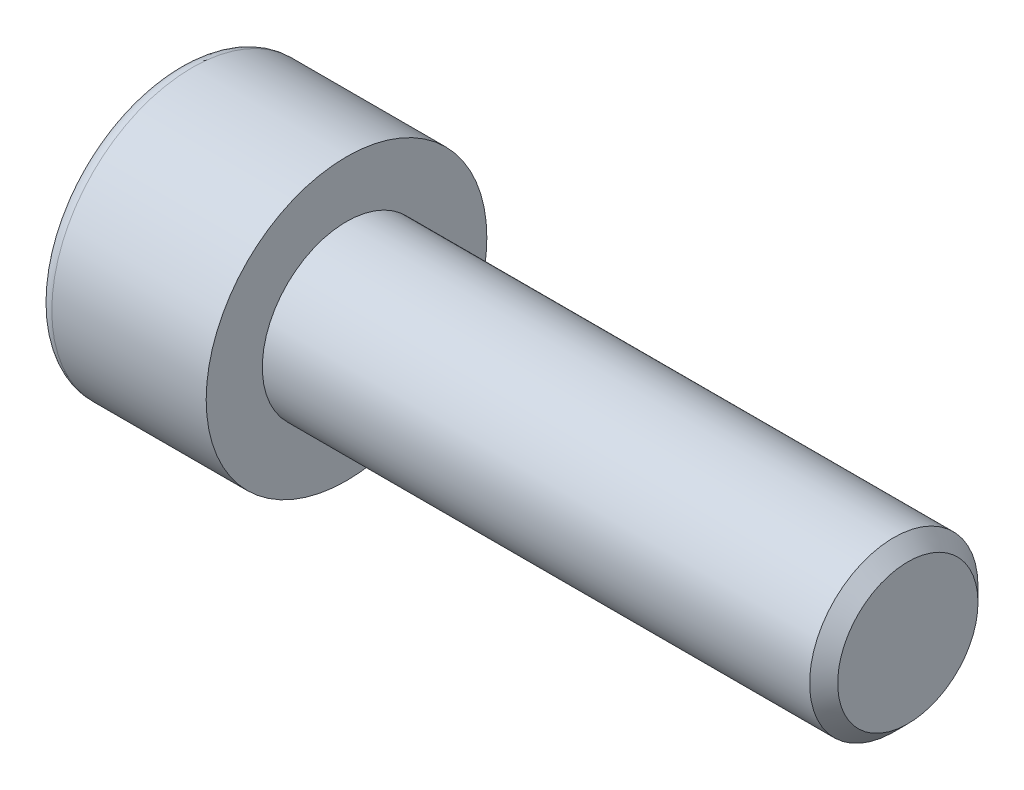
ISO-10303-21;
HEADER;
FILE_DESCRIPTION(('STEP AP214'),'2;1');
FILE_NAME('part.step','',(''),(''),'','','');
FILE_SCHEMA(('AUTOMOTIVE_DESIGN { 1 0 10303 214 1 1 1 1 }'));
ENDSEC;
DATA;
#1=APPLICATION_CONTEXT('core data for automotive mechanical design processes');
#2=APPLICATION_PROTOCOL_DEFINITION('international standard','automotive_design',2000,#1);
#3=PRODUCT_CONTEXT('',#1,'mechanical');
#4=PRODUCT('Part','Part','',(#3));
#5=PRODUCT_RELATED_PRODUCT_CATEGORY('part','',(#4));
#6=PRODUCT_DEFINITION_FORMATION('','',#4);
#7=PRODUCT_DEFINITION_CONTEXT('part definition',#1,'design');
#8=PRODUCT_DEFINITION('design','',#6,#7);
#9=PRODUCT_DEFINITION_SHAPE('','',#8);
#10=(LENGTH_UNIT() NAMED_UNIT(*) SI_UNIT(.MILLI.,.METRE.));
#11=(NAMED_UNIT(*) PLANE_ANGLE_UNIT() SI_UNIT($,.RADIAN.));
#12=(NAMED_UNIT(*) SI_UNIT($,.STERADIAN.) SOLID_ANGLE_UNIT());
#13=UNCERTAINTY_MEASURE_WITH_UNIT(LENGTH_MEASURE(1.E-05),#10,'distance_accuracy_value','');
#14=(GEOMETRIC_REPRESENTATION_CONTEXT(3) GLOBAL_UNCERTAINTY_ASSIGNED_CONTEXT((#13)) GLOBAL_UNIT_ASSIGNED_CONTEXT((#10,
#11,#12)) REPRESENTATION_CONTEXT('',''));
#15=CARTESIAN_POINT('',(0.,0.,0.));
#16=DIRECTION('',(0.,0.,1.));
#17=DIRECTION('',(1.,0.,0.));
#18=AXIS2_PLACEMENT_3D('',#15,#16,#17);
#19=CARTESIAN_POINT('',(12.5013072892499,0.,0.));
#20=DIRECTION('',(1.,0.,0.));
#21=DIRECTION('',(0.,0.,-1.));
#22=AXIS2_PLACEMENT_3D('',#19,#20,#21);
#23=CYLINDRICAL_SURFACE('',#22,3.);
#24=CARTESIAN_POINT('',(19.5,0.,0.));
#25=DIRECTION('',(1.,0.,0.));
#26=DIRECTION('',(0.,0.,-1.));
#27=AXIS2_PLACEMENT_3D('',#24,#25,#26);
#28=CIRCLE('',#27,3.);
#29=CARTESIAN_POINT('',(19.5,0.,-3.));
#30=VERTEX_POINT('',#29);
#31=EDGE_CURVE('E152',#30,#30,#28,.F.);
#32=ORIENTED_EDGE('',*,*,#31,.T.);
#33=EDGE_LOOP('',(#32));
#34=FACE_BOUND('',#33,.T.);
#35=CARTESIAN_POINT('',(0.,0.,0.));
#36=DIRECTION('',(1.,0.,0.));
#37=DIRECTION('',(0.,0.,-1.));
#38=AXIS2_PLACEMENT_3D('',#35,#36,#37);
#39=CIRCLE('',#38,3.);
#40=CARTESIAN_POINT('',(0.,0.,-3.));
#41=VERTEX_POINT('',#40);
#42=EDGE_CURVE('E138',#41,#41,#39,.T.);
#43=ORIENTED_EDGE('',*,*,#42,.T.);
#44=EDGE_LOOP('',(#43));
#45=FACE_BOUND('',#44,.T.);
#46=ADVANCED_FACE('F36',(#34,#45),#23,.T.);
#47=CARTESIAN_POINT('',(20.,3.,0.));
#48=DIRECTION('',(1.,0.,0.));
#49=DIRECTION('',(0.,0.,-1.));
#50=AXIS2_PLACEMENT_3D('',#47,#48,#49);
#51=PLANE('',#50);
#52=CARTESIAN_POINT('',(20.,0.,0.));
#53=DIRECTION('',(1.,0.,0.));
#54=DIRECTION('',(0.,0.,-1.));
#55=AXIS2_PLACEMENT_3D('',#52,#53,#54);
#56=CIRCLE('',#55,2.5);
#57=CARTESIAN_POINT('',(20.,0.,-2.5));
#58=VERTEX_POINT('',#57);
#59=EDGE_CURVE('E149',#58,#58,#56,.T.);
#60=ORIENTED_EDGE('',*,*,#59,.T.);
#61=EDGE_LOOP('',(#60));
#62=FACE_BOUND('',#61,.T.);
#63=ADVANCED_FACE('F174',(#62),#51,.T.);
#64=CARTESIAN_POINT('',(-6.,5.,0.));
#65=DIRECTION('',(-1.,0.,0.));
#66=DIRECTION('',(0.,0.,1.));
#67=AXIS2_PLACEMENT_3D('',#64,#65,#66);
#68=PLANE('',#67);
#69=DIRECTION('',(0.,0.866025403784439,0.5));
#70=VECTOR('',#69,1.);
#71=CARTESIAN_POINT('',(-6.,-2.5,1.44337567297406));
#72=LINE('',#71,#70);
#73=CARTESIAN_POINT('',(-6.,-2.5,1.44337567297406));
#74=VERTEX_POINT('',#73);
#75=CARTESIAN_POINT('',(-6.,0.,2.88675134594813));
#76=VERTEX_POINT('',#75);
#77=EDGE_CURVE('E51',#74,#76,#72,.T.);
#78=ORIENTED_EDGE('',*,*,#77,.F.);
#79=DIRECTION('',(0.,0.,1.));
#80=VECTOR('',#79,1.);
#81=CARTESIAN_POINT('',(-6.,-2.5,-1.44337567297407));
#82=LINE('',#81,#80);
#83=CARTESIAN_POINT('',(-6.,-2.5,-1.44337567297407));
#84=VERTEX_POINT('',#83);
#85=EDGE_CURVE('E134',#84,#74,#82,.T.);
#86=ORIENTED_EDGE('',*,*,#85,.F.);
#87=DIRECTION('',(0.,-0.866025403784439,0.5));
#88=VECTOR('',#87,1.);
#89=CARTESIAN_POINT('',(-6.,0.,-2.88675134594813));
#90=LINE('',#89,#88);
#91=CARTESIAN_POINT('',(-6.,0.,-2.88675134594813));
#92=VERTEX_POINT('',#91);
#93=EDGE_CURVE('E132',#92,#84,#90,.T.);
#94=ORIENTED_EDGE('',*,*,#93,.F.);
#95=DIRECTION('',(0.,-0.866025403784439,-0.5));
#96=VECTOR('',#95,1.);
#97=CARTESIAN_POINT('',(-6.,2.5,-1.44337567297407));
#98=LINE('',#97,#96);
#99=CARTESIAN_POINT('',(-6.,2.5,-1.44337567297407));
#100=VERTEX_POINT('',#99);
#101=EDGE_CURVE('E99',#100,#92,#98,.T.);
#102=ORIENTED_EDGE('',*,*,#101,.F.);
#103=DIRECTION('',(0.,0.,-1.));
#104=VECTOR('',#103,1.);
#105=CARTESIAN_POINT('',(-6.,2.5,1.44337567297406));
#106=LINE('',#105,#104);
#107=CARTESIAN_POINT('',(-6.,2.5,1.44337567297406));
#108=VERTEX_POINT('',#107);
#109=EDGE_CURVE('E128',#108,#100,#106,.T.);
#110=ORIENTED_EDGE('',*,*,#109,.F.);
#111=DIRECTION('',(0.,0.866025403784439,-0.5));
#112=VECTOR('',#111,1.);
#113=CARTESIAN_POINT('',(-6.,0.,2.88675134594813));
#114=LINE('',#113,#112);
#115=EDGE_CURVE('E125',#76,#108,#114,.T.);
#116=ORIENTED_EDGE('',*,*,#115,.F.);
#117=EDGE_LOOP('',(#78,#86,#94,#102,#110,#116));
#118=FACE_BOUND('',#117,.T.);
#119=CARTESIAN_POINT('',(-6.,0.,0.));
#120=DIRECTION('',(-1.,0.,0.));
#121=DIRECTION('',(0.,0.,1.));
#122=AXIS2_PLACEMENT_3D('',#119,#120,#121);
#123=CIRCLE('',#122,4.5);
#124=CARTESIAN_POINT('',(-6.,0.,4.5));
#125=VERTEX_POINT('',#124);
#126=EDGE_CURVE('E11',#125,#125,#123,.T.);
#127=ORIENTED_EDGE('',*,*,#126,.T.);
#128=EDGE_LOOP('',(#127));
#129=FACE_BOUND('',#128,.T.);
#130=ADVANCED_FACE('F180',(#118,#129),#68,.T.);
#131=CARTESIAN_POINT('',(12.5013072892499,0.,0.));
#132=DIRECTION('',(1.,0.,0.));
#133=DIRECTION('',(0.,0.,-1.));
#134=AXIS2_PLACEMENT_3D('',#131,#132,#133);
#135=CYLINDRICAL_SURFACE('',#134,5.);
#136=CARTESIAN_POINT('',(-5.5,0.,0.));
#137=DIRECTION('',(-1.,0.,0.));
#138=DIRECTION('',(0.,0.,1.));
#139=AXIS2_PLACEMENT_3D('',#136,#137,#138);
#140=CIRCLE('',#139,5.);
#141=CARTESIAN_POINT('',(-5.5,0.,5.));
#142=VERTEX_POINT('',#141);
#143=EDGE_CURVE('E44',#142,#142,#140,.F.);
#144=ORIENTED_EDGE('',*,*,#143,.T.);
#145=EDGE_LOOP('',(#144));
#146=FACE_BOUND('',#145,.T.);
#147=CARTESIAN_POINT('',(0.,0.,0.));
#148=DIRECTION('',(1.,0.,0.));
#149=DIRECTION('',(0.,0.,-1.));
#150=AXIS2_PLACEMENT_3D('',#147,#148,#149);
#151=CIRCLE('',#150,5.);
#152=CARTESIAN_POINT('',(0.,0.,-5.));
#153=VERTEX_POINT('',#152);
#154=EDGE_CURVE('E146',#153,#153,#151,.T.);
#155=ORIENTED_EDGE('',*,*,#154,.F.);
#156=EDGE_LOOP('',(#155));
#157=FACE_BOUND('',#156,.T.);
#158=ADVANCED_FACE('F157',(#146,#157),#135,.T.);
#159=CARTESIAN_POINT('',(0.,3.,0.));
#160=DIRECTION('',(1.,0.,0.));
#161=DIRECTION('',(0.,0.,-1.));
#162=AXIS2_PLACEMENT_3D('',#159,#160,#161);
#163=PLANE('',#162);
#164=ORIENTED_EDGE('',*,*,#154,.T.);
#165=EDGE_LOOP('',(#164));
#166=FACE_BOUND('',#165,.T.);
#167=ORIENTED_EDGE('',*,*,#42,.F.);
#168=EDGE_LOOP('',(#167));
#169=FACE_BOUND('',#168,.T.);
#170=ADVANCED_FACE('F170',(#166,#169),#163,.T.);
#171=CARTESIAN_POINT('',(20.,0.,0.));
#172=DIRECTION('',(-1.,0.,0.));
#173=DIRECTION('',(0.,0.,1.));
#174=AXIS2_PLACEMENT_3D('',#171,#172,#173);
#175=CONICAL_SURFACE('',#174,2.5,0.785398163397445);
#176=ORIENTED_EDGE('',*,*,#31,.F.);
#177=EDGE_LOOP('',(#176));
#178=FACE_BOUND('',#177,.T.);
#179=ORIENTED_EDGE('',*,*,#59,.F.);
#180=EDGE_LOOP('',(#179));
#181=FACE_BOUND('',#180,.T.);
#182=ADVANCED_FACE('F162',(#178,#181),#175,.T.);
#183=CARTESIAN_POINT('',(-5.5,0.,0.));
#184=DIRECTION('',(-1.,0.,0.));
#185=DIRECTION('',(0.,0.,1.));
#186=AXIS2_PLACEMENT_3D('',#183,#184,#185);
#187=TOROIDAL_SURFACE('',#186,4.5,0.5);
#188=ORIENTED_EDGE('',*,*,#126,.F.);
#189=EDGE_LOOP('',(#188));
#190=FACE_BOUND('',#189,.T.);
#191=ORIENTED_EDGE('',*,*,#143,.F.);
#192=EDGE_LOOP('',(#191));
#193=FACE_BOUND('',#192,.T.);
#194=ADVANCED_FACE('F38',(#190,#193),#187,.T.);
#195=CARTESIAN_POINT('',(-2.22,-2.5,1.44337567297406));
#196=DIRECTION('',(0.,-0.5,0.866025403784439));
#197=DIRECTION('',(0.,-0.866025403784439,-0.5));
#198=AXIS2_PLACEMENT_3D('',#195,#196,#197);
#199=PLANE('',#198);
#200=ORIENTED_EDGE('',*,*,#77,.T.);
#201=DIRECTION('',(-1.,0.,0.));
#202=VECTOR('',#201,1.);
#203=CARTESIAN_POINT('',(-2.22,0.,2.88675134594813));
#204=LINE('',#203,#202);
#205=CARTESIAN_POINT('',(-2.22,0.,2.88675134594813));
#206=VERTEX_POINT('',#205);
#207=EDGE_CURVE('E81',#206,#76,#204,.T.);
#208=ORIENTED_EDGE('',*,*,#207,.F.);
#209=DIRECTION('',(0.,0.866025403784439,0.5));
#210=VECTOR('',#209,1.);
#211=CARTESIAN_POINT('',(-2.22,-2.5,1.44337567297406));
#212=LINE('',#211,#210);
#213=CARTESIAN_POINT('',(-2.22,-2.5,1.44337567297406));
#214=VERTEX_POINT('',#213);
#215=EDGE_CURVE('E136',#214,#206,#212,.T.);
#216=ORIENTED_EDGE('',*,*,#215,.F.);
#217=DIRECTION('',(-1.,0.,0.));
#218=VECTOR('',#217,1.);
#219=CARTESIAN_POINT('',(-2.22,-2.5,1.44337567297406));
#220=LINE('',#219,#218);
#221=EDGE_CURVE('E59',#214,#74,#220,.T.);
#222=ORIENTED_EDGE('',*,*,#221,.T.);
#223=EDGE_LOOP('',(#200,#208,#216,#222));
#224=FACE_BOUND('',#223,.T.);
#225=ADVANCED_FACE('F161',(#224),#199,.F.);
#226=CARTESIAN_POINT('',(-2.22,-2.5,-1.44337567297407));
#227=DIRECTION('',(0.,-1.,0.));
#228=DIRECTION('',(0.,0.,-1.));
#229=AXIS2_PLACEMENT_3D('',#226,#227,#228);
#230=PLANE('',#229);
#231=ORIENTED_EDGE('',*,*,#85,.T.);
#232=ORIENTED_EDGE('',*,*,#221,.F.);
#233=DIRECTION('',(0.,0.,1.));
#234=VECTOR('',#233,1.);
#235=CARTESIAN_POINT('',(-2.22,-2.5,-1.44337567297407));
#236=LINE('',#235,#234);
#237=CARTESIAN_POINT('',(-2.22,-2.5,-1.44337567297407));
#238=VERTEX_POINT('',#237);
#239=EDGE_CURVE('E111',#238,#214,#236,.T.);
#240=ORIENTED_EDGE('',*,*,#239,.F.);
#241=DIRECTION('',(-1.,0.,0.));
#242=VECTOR('',#241,1.);
#243=CARTESIAN_POINT('',(-2.22,-2.5,-1.44337567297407));
#244=LINE('',#243,#242);
#245=EDGE_CURVE('E103',#238,#84,#244,.T.);
#246=ORIENTED_EDGE('',*,*,#245,.T.);
#247=EDGE_LOOP('',(#231,#232,#240,#246));
#248=FACE_BOUND('',#247,.T.);
#249=ADVANCED_FACE('F168',(#248),#230,.F.);
#250=CARTESIAN_POINT('',(-2.22,0.,-2.88675134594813));
#251=DIRECTION('',(0.,-0.5,-0.866025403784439));
#252=DIRECTION('',(0.,0.866025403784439,-0.5));
#253=AXIS2_PLACEMENT_3D('',#250,#251,#252);
#254=PLANE('',#253);
#255=ORIENTED_EDGE('',*,*,#93,.T.);
#256=ORIENTED_EDGE('',*,*,#245,.F.);
#257=DIRECTION('',(0.,-0.866025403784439,0.5));
#258=VECTOR('',#257,1.);
#259=CARTESIAN_POINT('',(-2.22,0.,-2.88675134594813));
#260=LINE('',#259,#258);
#261=CARTESIAN_POINT('',(-2.22,0.,-2.88675134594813));
#262=VERTEX_POINT('',#261);
#263=EDGE_CURVE('E107',#262,#238,#260,.T.);
#264=ORIENTED_EDGE('',*,*,#263,.F.);
#265=DIRECTION('',(-1.,0.,0.));
#266=VECTOR('',#265,1.);
#267=CARTESIAN_POINT('',(-2.22,0.,-2.88675134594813));
#268=LINE('',#267,#266);
#269=EDGE_CURVE('E92',#262,#92,#268,.T.);
#270=ORIENTED_EDGE('',*,*,#269,.T.);
#271=EDGE_LOOP('',(#255,#256,#264,#270));
#272=FACE_BOUND('',#271,.T.);
#273=ADVANCED_FACE('F108',(#272),#254,.F.);
#274=CARTESIAN_POINT('',(-2.22,2.5,-1.44337567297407));
#275=DIRECTION('',(0.,0.5,-0.866025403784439));
#276=DIRECTION('',(0.,0.866025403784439,0.5));
#277=AXIS2_PLACEMENT_3D('',#274,#275,#276);
#278=PLANE('',#277);
#279=ORIENTED_EDGE('',*,*,#101,.T.);
#280=ORIENTED_EDGE('',*,*,#269,.F.);
#281=DIRECTION('',(0.,-0.866025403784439,-0.5));
#282=VECTOR('',#281,1.);
#283=CARTESIAN_POINT('',(-2.22,2.5,-1.44337567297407));
#284=LINE('',#283,#282);
#285=CARTESIAN_POINT('',(-2.22,2.5,-1.44337567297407));
#286=VERTEX_POINT('',#285);
#287=EDGE_CURVE('E96',#286,#262,#284,.T.);
#288=ORIENTED_EDGE('',*,*,#287,.F.);
#289=DIRECTION('',(-1.,0.,0.));
#290=VECTOR('',#289,1.);
#291=CARTESIAN_POINT('',(-2.22,2.5,-1.44337567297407));
#292=LINE('',#291,#290);
#293=EDGE_CURVE('E104',#286,#100,#292,.T.);
#294=ORIENTED_EDGE('',*,*,#293,.T.);
#295=EDGE_LOOP('',(#279,#280,#288,#294));
#296=FACE_BOUND('',#295,.T.);
#297=ADVANCED_FACE('F94',(#296),#278,.F.);
#298=CARTESIAN_POINT('',(-2.22,2.5,1.44337567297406));
#299=DIRECTION('',(0.,1.,0.));
#300=DIRECTION('',(0.,0.,1.));
#301=AXIS2_PLACEMENT_3D('',#298,#299,#300);
#302=PLANE('',#301);
#303=ORIENTED_EDGE('',*,*,#109,.T.);
#304=ORIENTED_EDGE('',*,*,#293,.F.);
#305=DIRECTION('',(0.,0.,-1.));
#306=VECTOR('',#305,1.);
#307=CARTESIAN_POINT('',(-2.22,2.5,1.44337567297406));
#308=LINE('',#307,#306);
#309=CARTESIAN_POINT('',(-2.22,2.5,1.44337567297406));
#310=VERTEX_POINT('',#309);
#311=EDGE_CURVE('E117',#310,#286,#308,.T.);
#312=ORIENTED_EDGE('',*,*,#311,.F.);
#313=DIRECTION('',(-1.,0.,0.));
#314=VECTOR('',#313,1.);
#315=CARTESIAN_POINT('',(-2.22,2.5,1.44337567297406));
#316=LINE('',#315,#314);
#317=EDGE_CURVE('E141',#310,#108,#316,.T.);
#318=ORIENTED_EDGE('',*,*,#317,.T.);
#319=EDGE_LOOP('',(#303,#304,#312,#318));
#320=FACE_BOUND('',#319,.T.);
#321=ADVANCED_FACE('F196',(#320),#302,.F.);
#322=CARTESIAN_POINT('',(-2.22,0.,2.88675134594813));
#323=DIRECTION('',(0.,0.5,0.866025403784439));
#324=DIRECTION('',(0.,-0.866025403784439,0.5));
#325=AXIS2_PLACEMENT_3D('',#322,#323,#324);
#326=PLANE('',#325);
#327=ORIENTED_EDGE('',*,*,#115,.T.);
#328=ORIENTED_EDGE('',*,*,#317,.F.);
#329=DIRECTION('',(0.,0.866025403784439,-0.5));
#330=VECTOR('',#329,1.);
#331=CARTESIAN_POINT('',(-2.22,0.,2.88675134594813));
#332=LINE('',#331,#330);
#333=EDGE_CURVE('E119',#206,#310,#332,.T.);
#334=ORIENTED_EDGE('',*,*,#333,.F.);
#335=ORIENTED_EDGE('',*,*,#207,.T.);
#336=EDGE_LOOP('',(#327,#328,#334,#335));
#337=FACE_BOUND('',#336,.T.);
#338=ADVANCED_FACE('F193',(#337),#326,.F.);
#339=CARTESIAN_POINT('',(-2.22,2.5,4.3301270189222));
#340=DIRECTION('',(-1.,0.,0.));
#341=DIRECTION('',(0.,0.,1.));
#342=AXIS2_PLACEMENT_3D('',#339,#340,#341);
#343=PLANE('',#342);
#344=ORIENTED_EDGE('',*,*,#215,.T.);
#345=ORIENTED_EDGE('',*,*,#333,.T.);
#346=ORIENTED_EDGE('',*,*,#311,.T.);
#347=ORIENTED_EDGE('',*,*,#287,.T.);
#348=ORIENTED_EDGE('',*,*,#263,.T.);
#349=ORIENTED_EDGE('',*,*,#239,.T.);
#350=EDGE_LOOP('',(#344,#345,#346,#347,#348,#349));
#351=FACE_BOUND('',#350,.T.);
#352=ADVANCED_FACE('F114',(#351),#343,.T.);
#353=CLOSED_SHELL('',(#46,#63,#130,#158,#170,#182,#194,#225,#249,#273,#297,#321,#338,#352));
#354=MANIFOLD_SOLID_BREP('B2',#353);
#355=ADVANCED_BREP_SHAPE_REPRESENTATION('',(#18,#354),#14);
#356=SHAPE_DEFINITION_REPRESENTATION(#9,#355);
ENDSEC;
END-ISO-10303-21;
